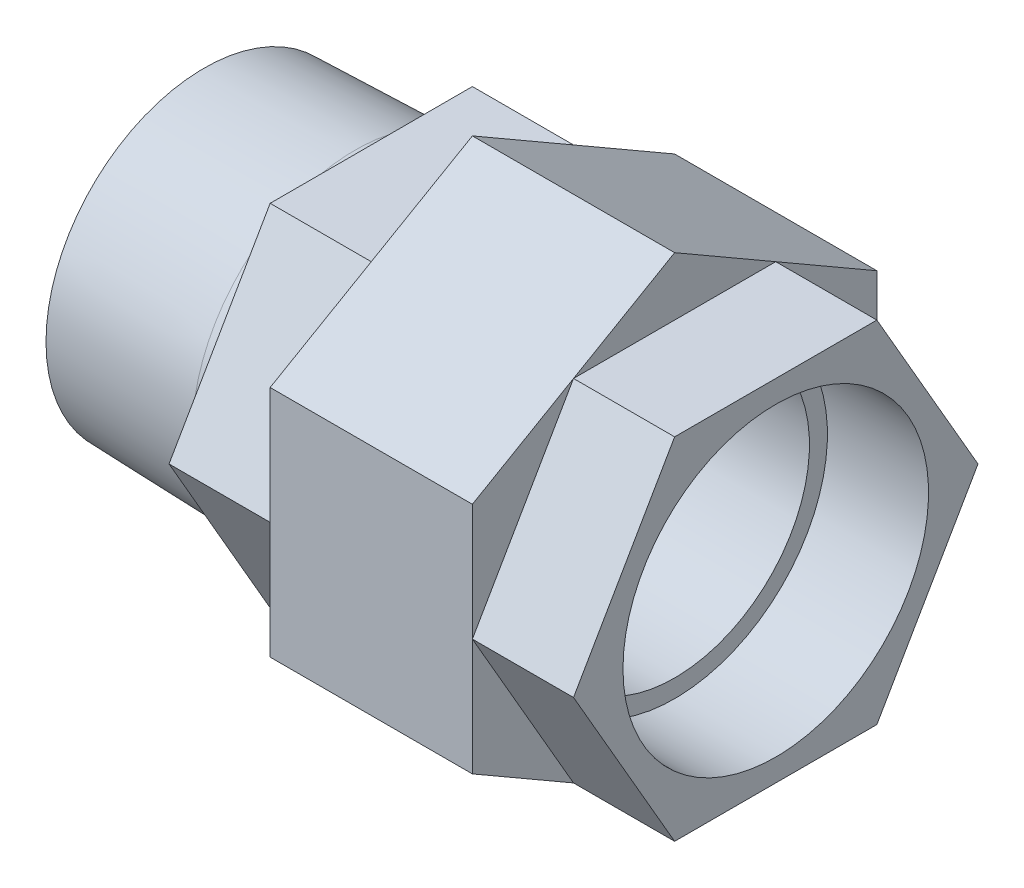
from build123d import *

# Parameters (mm, degrees)
BOSS_EXTRU_1_START = -37.5
ESQUISSE2_R        = 25
BOSS_EXTRU_1_DEPTH = 37.5
BOSS_EXTRU_2_START = -18.75
ESQUISSE3_R        = 25
BOSS_EXTRU_2_DEPTH = 18.75
ESQUISSE4_R        = 30.65
BOSS_EXTRU_3_DEPTH = 18.75


with BuildPart() as part:
    # Esquisse1 → Base-R_volution (revolve)
    with BuildSketch(Plane.XY, mode=Mode.PRIVATE) as base_r_volution_sk:
        Polygon((7, 30.15), (4, 30.15), (-24, 29.3105), (-24, 25), (58.2, 25), (58.2, 28.3295), (82, 28.3295), (82, 30.65), (63.25, 30.65), (63.25, 37.5), (25.75, 37.5), (25.75, 30.65), (7, 30.65), align=None)
    revolve(base_r_volution_sk.sketch.rotate(Axis((-65.348926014, 0, 0), (1, 0, 0)), 90), axis=Axis((-65.348926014, 0, 0), (1, 0, 0)))

    # Esquisse2 → Boss.-Extru.1 (add)
    with BuildSketch(Plane.ZY.offset(-25.75).offset(BOSS_EXTRU_1_START)):
        Polygon((37.5, -21.650635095), (37.5, 21.650635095), (0, 43.301270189), (-37.5, 21.650635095), (-37.5, -21.650635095), (0, -43.301270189), align=None)
        Circle(ESQUISSE2_R, mode=Mode.SUBTRACT)
    extrude(amount=BOSS_EXTRU_1_DEPTH)

    # Esquisse3 → Boss.-Extru.2 (add)
    with BuildSketch(Plane.ZY.offset(-7).offset(BOSS_EXTRU_2_START)):
        Polygon((37.5, 0), (18.75, 32.475952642), (-18.75, 32.475952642), (-37.5, 0), (-18.75, -32.475952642), (18.75, -32.475952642), align=None)
        Circle(ESQUISSE3_R, mode=Mode.SUBTRACT)
    extrude(amount=BOSS_EXTRU_2_DEPTH)

    # Esquisse4 → Boss.-Extru.3 (add)
    with BuildSketch(Plane(origin=(63.25, 0, 0), x_dir=(0, 0, -1), z_dir=(1, 0, 0))):
        Polygon((18.75, -32.475952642), (37.5, 0), (18.75, 32.475952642), (-18.75, 32.475952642), (-37.5, 0), (-18.75, -32.475952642), align=None)
        Circle(ESQUISSE4_R, mode=Mode.SUBTRACT)
    extrude(amount=BOSS_EXTRU_3_DEPTH)


solid = part.part
